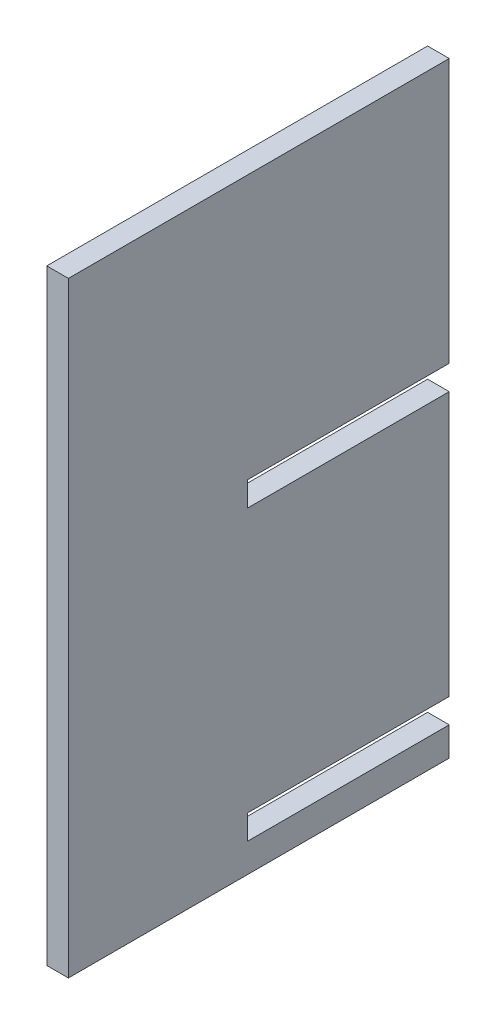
from build123d import *

# Parameters (mm, degrees)
CROQUIS16_W             = 1.5
CROQUIS16_H             = 79.5
SALIENTE_EXTRUIR9_DEPTH = 26.4
CROQUIS20_W             = 14
CROQUIS20_H             = 1.7
CORTAR_EXTRUIR2_DEPTH   = 1.5
CROQUIS21_W             = 26.4
CROQUIS21_H             = 16.9
CROQUIS21_H_2           = 20.6
CORTAR_EXTRUIR3_DEPTH   = 1.5


with BuildPart() as part:
    # Croquis16 → Saliente-Extruir9 (new body)
    with BuildSketch(Plane.XY):
        with Locations((-17.5, 0)):
            Rectangle(CROQUIS16_W, CROQUIS16_H)
    extrude(amount=SALIENTE_EXTRUIR9_DEPTH)

    # Croquis20 → Cortar-Extruir2 (cut)
    with BuildSketch(Plane(origin=(-16.75, 0, 0), x_dir=(0, 0, -1), z_dir=(1, 0, 0))):
        with Locations((-7, -20)):
            Rectangle(CROQUIS20_W, CROQUIS20_H)
        with Locations((-7, 0)):
            Rectangle(CROQUIS20_W, CROQUIS20_H)
        with Locations((-7, 20)):
            Rectangle(CROQUIS20_W, CROQUIS20_H)
    extrude(amount=-CORTAR_EXTRUIR2_DEPTH, mode=Mode.SUBTRACT)

    # Croquis21 → Cortar-Extruir3 (cut)
    with BuildSketch(Plane(origin=(-16.75, 0, 0), x_dir=(0, 0, -1), z_dir=(1, 0, 0))):
        with Locations((-13.2, -31.3)):
            Rectangle(CROQUIS21_W, CROQUIS21_H)
        with Locations((-13.2, 29.45)):
            Rectangle(CROQUIS21_W, CROQUIS21_H_2)
    extrude(amount=-CORTAR_EXTRUIR3_DEPTH, mode=Mode.SUBTRACT)


solid = part.part
